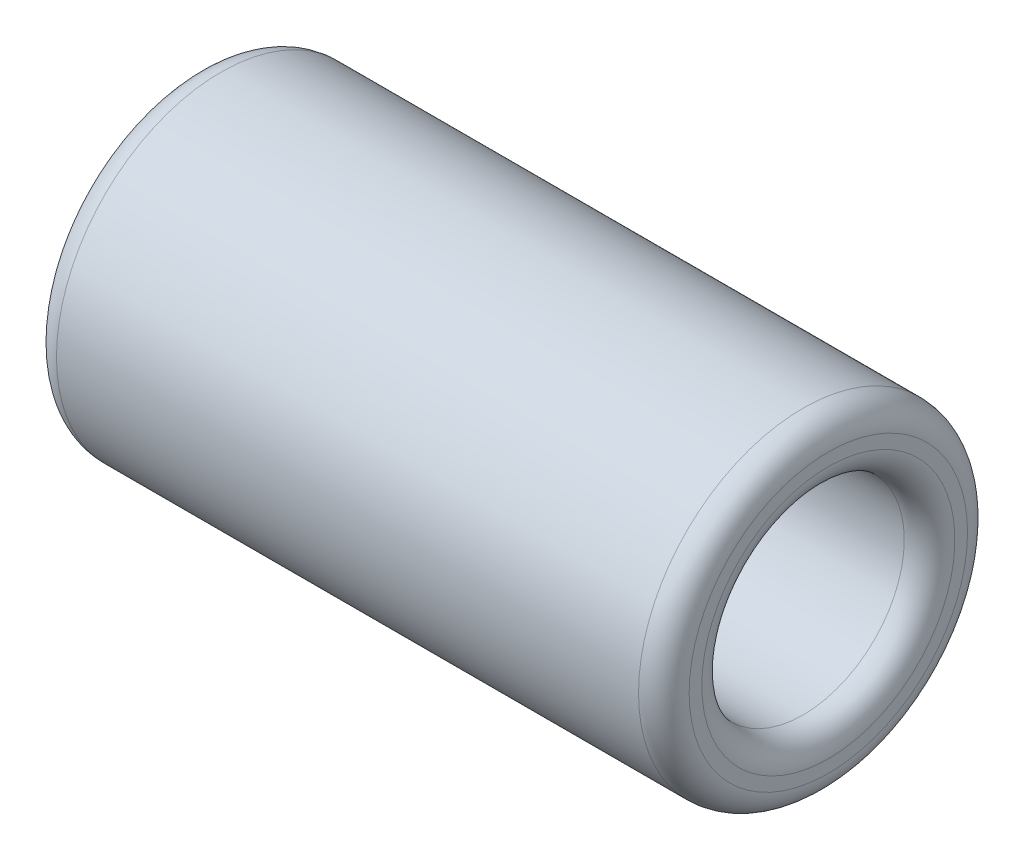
from build123d import *


with BuildPart() as part:
    # Esquisse1 → R_volution1 (revolve)
    with BuildSketch(Plane.XY, mode=Mode.PRIVATE) as r_volution1_sk:
        with BuildLine():
            Line((0.4, 1.6), (9.6, 1.6))
            ThreePointArc((9.6, 1.6), (9.882842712, 1.717157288), (10, 2))
            Line((10, 2), (10, 2.2))
            ThreePointArc((10, 2.2), (9.882842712, 2.482842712), (9.6, 2.6))
            Line((9.6, 2.6), (0.4, 2.6))
            ThreePointArc((0.4, 2.6), (0.117157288, 2.482842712), (0, 2.2))
            Line((0, 2.2), (0, 2))
            ThreePointArc((0, 2), (0.117157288, 1.717157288), (0.4, 1.6))
        make_face()
    revolve(r_volution1_sk.sketch.rotate(Axis((0, 0, 0), (1, 0, 0)), 90), axis=Axis((0, 0, 0), (1, 0, 0)))


solid = part.part
